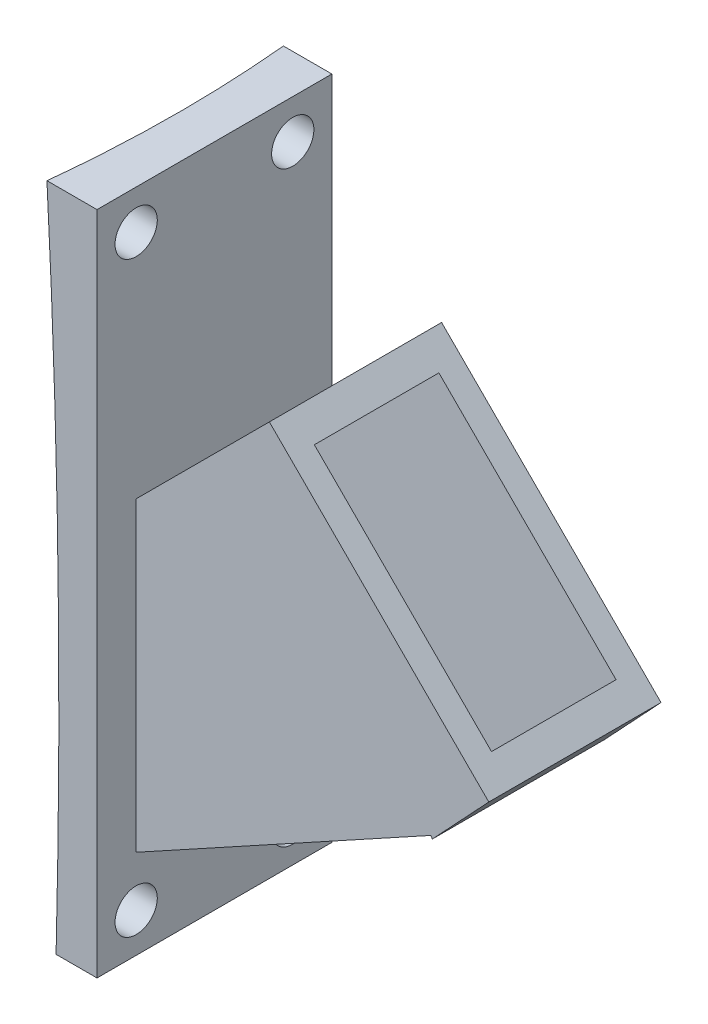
from build123d import *

# Parameters (mm, degrees)
SKETCH1_W               = 15.24
SKETCH1_H               = 47.25
BOSS_EXTRUDE1_DEPTH     = 29
BOSS_EXTRUDE2_DEPTH     = 15.24
BOSS_EXTRUDE3_START     = 6.35
BOSS_EXTRUDE3_DEPTH     = 27.94
CUT_EXTRUDE4_DEPTH      = 90.856122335
CUT_EXTRUDE4_DEPTH_BACK = 90.856122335
BOSS_EXTRUDE4_START     = 12.7
SKETCH15_W              = 12.73404056
SKETCH15_H              = 107.95
BOSS_EXTRUDE4_DEPTH     = 38.1
SKETCH17_R              = 3.429
CUT_EXTRUDE6_DEPTH      = 95.762638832
BOSS_EXTRUDE9_DEPTH     = 6.35
BOSS_EXTRUDE10_DEPTH    = 6.35
SKETCH12_W              = 20.20062
SKETCH12_H              = 40.64
CUT_EXTRUDE8_DEPTH      = 38.1


with BuildPart() as part:
    # Sketch1 → Boss-Extrude1 (new body)
    with BuildSketch(Plane(origin=(0, 0, 0), x_dir=(0, 0, -1), z_dir=(1, 0, 0))):
        Rectangle(SKETCH1_W, SKETCH1_H)
    extrude(amount=BOSS_EXTRUDE1_DEPTH)

    # Sketch8 → Cut-Revolve1 (revolve, cut)
    with BuildSketch(Plane(origin=(0, 0, 0), x_dir=(1, 0, 0), z_dir=(0, 1, 0))):
        with BuildLine():
            Line((-1363.98, 509.27), (-1363.98, -509.27))
            add(Edge.make_bspline(
                [(-1363.98, -509.27), (8.89, -509.27), (8.89, 0), (8.89, 509.27), (-1363.98, 509.27)],
                knots=[4.71238898, 4.71238898, 4.71238898, 6.283185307, 6.283185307, 7.853981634, 7.853981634, 7.853981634], degree=2, weights=[1, 0.707106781, 1, 0.707106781, 1]))
        make_face()
    revolve(axis=Axis((-1363.98, 0, -509.27), (0, 0, 1)), mode=Mode.SUBTRACT)

    # Sketch9 → Boss-Extrude2 (add)
    with BuildSketch(Plane.XY.offset(7.62)):
        Polygon((29, -23.625), (57.293684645, -23.625), (29, 23.625), align=None)
    extrude(amount=-BOSS_EXTRUDE2_DEPTH)

    # Sketch11 → Boss-Extrude3 (add)
    with BuildSketch(Plane(origin=(0, 0, -7.62), x_dir=(-1, 0, 0), z_dir=(0, 0, -1)).offset(BOSS_EXTRUDE3_START)):
        Polygon((-8.532999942, 23.625), (-35.473768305, 50.565768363), (-71.071074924, 14.968461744), (-48.573634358, -9.062655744), (-29, 23.625), align=None)
    extrude(amount=-BOSS_EXTRUDE3_DEPTH)

    # Sketch13 → Cut-Extrude4 (cut, two sides: drawn at the far end of the back side and taken through both)
    with BuildSketch(Plane(origin=(0, 0, -7.62), x_dir=(-1, 0, 0), z_dir=(0, 0, -1)).offset(-CUT_EXTRUDE4_DEPTH_BACK)):
        Polygon((-61.672265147, 5.569651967), (-8.532999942, -23.625), (-25.014556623, -53.624255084), (-79.616003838, -23.626281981), align=None)
    extrude(amount=CUT_EXTRUDE4_DEPTH + CUT_EXTRUDE4_DEPTH_BACK, mode=Mode.SUBTRACT)

    # Sketch15 → Boss-Extrude4 (add)
    with BuildSketch(Plane.XY.offset(7.62).offset(BOSS_EXTRUDE4_START)):
        with Locations((7.499979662, 18.790026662)):
            Rectangle(SKETCH15_W, SKETCH15_H)
    extrude(amount=-BOSS_EXTRUDE4_DEPTH)

    # Sketch16 → Cut-Revolve2 (revolve, cut)
    with BuildSketch(Plane(origin=(0, 0, 0), x_dir=(1, 0, 0), z_dir=(0, 1, 0))):
        with BuildLine():
            Line((-1364.099005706, 509.27), (-1364.099005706, -509.27))
            add(Edge.make_bspline(
                [(-1364.099005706, -509.27), (8.770994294, -509.27), (8.770994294, 0), (8.770994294, 509.27), (-1364.099005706, 509.27)],
                knots=[4.71238898, 4.71238898, 4.71238898, 6.283185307, 6.283185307, 7.853981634, 7.853981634, 7.853981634], degree=2, weights=[1, 0.707106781, 1, 0.707106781, 1]))
        make_face()
    revolve(axis=Axis((-1364.099005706, 0, -509.27), (0, 0, 1)), mode=Mode.SUBTRACT)

    # Sketch17 → Cut-Extrude6 (cut, through all)
    with BuildSketch(Plane(origin=(13.866999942, 0, 0), x_dir=(0, 0, -1), z_dir=(1, 0, 0))):
        with Locations(Location((-13.97, -28.834973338, 0), (0, 0, 90))):
            Circle(SKETCH17_R)
        with Locations(Location((-13.97, 66.415026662, 0), (0, 0, 90))):
            Circle(SKETCH17_R)
        with Locations(Location((11.43, 66.415026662, 0), (0, 0, 90))):
            Circle(SKETCH17_R)
        with Locations(Location((11.43, -28.834973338, 0), (0, 0, 90))):
            Circle(SKETCH17_R)
    extrude(amount=-CUT_EXTRUDE6_DEPTH, mode=Mode.SUBTRACT)

    # Sketch19 → Boss-Extrude9 (add)
    with BuildSketch(Plane.XY.offset(7.62)):
        Polygon((29, 23.625), (13.866999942, 23.625), (13.866999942, -20.694506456), (45.223182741, -3.46745523), align=None)
    extrude(amount=BOSS_EXTRUDE9_DEPTH)

    # Sketch20 → Boss-Extrude10 (add)
    with BuildSketch(Plane(origin=(0, 0, -7.62), x_dir=(-1, 0, 0), z_dir=(0, 0, -1))):
        Polygon((-45.223182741, -3.46745523), (-13.866999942, -20.694506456), (-13.866999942, 23.625), (-29, 23.625), align=None)
    extrude(amount=BOSS_EXTRUDE10_DEPTH)

    # Sketch12 → Cut-Extrude8 (cut)
    with BuildSketch(Plane(origin=(43.019768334, 43.019768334, 0), x_dir=(0, 0, -1), z_dir=(0.7071067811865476, 0.7071067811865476, 0))):
        with Locations((0, -14.49944132)):
            Rectangle(SKETCH12_W, SKETCH12_H)
    extrude(amount=-CUT_EXTRUDE8_DEPTH, mode=Mode.SUBTRACT)


solid = part.part
